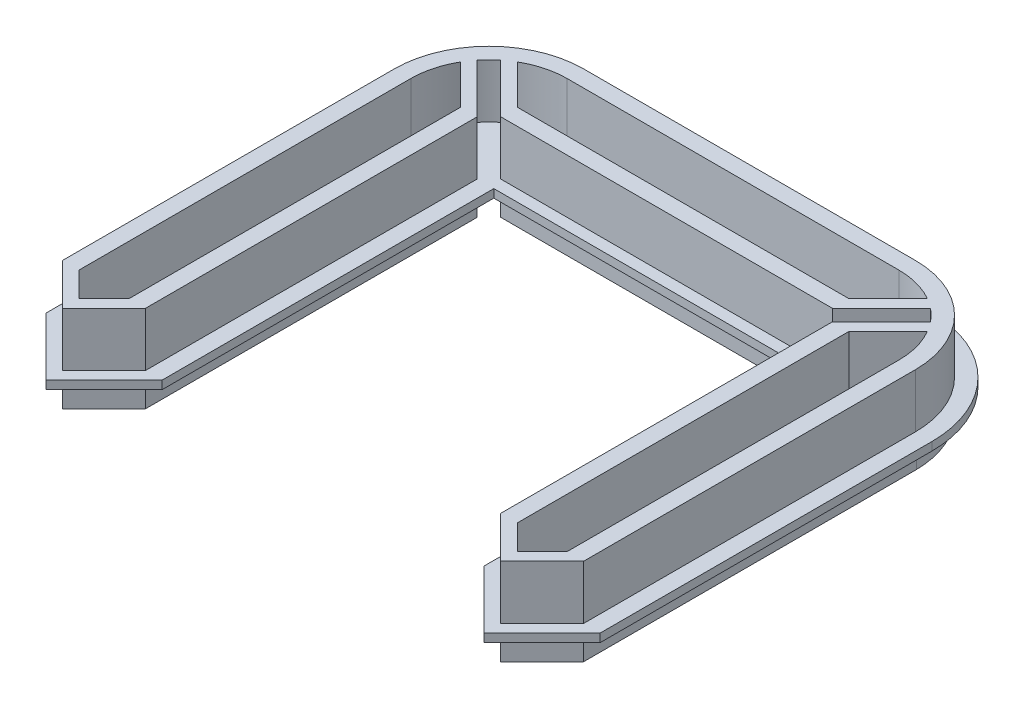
from build123d import *

# Parameters (mm, degrees)
SALIENTE_EXTRUIR3_DEPTH   = 4
SALIENTE_EXTRUIR3_2_DEPTH = 4
SALIENTE_EXTRUIR3_3_DEPTH = 4
SALIENTE_EXTRUIR4_START   = -1
SALIENTE_EXTRUIR4_DEPTH   = 1
SALIENTE_EXTRUIR5_START   = -1
SALIENTE_EXTRUIR5_DEPTH   = 1
CORTAR_EXTRUIR2_DEPTH     = 4
SALIENTE_EXTRUIR6_DEPTH   = 1
SALIENTE_EXTRUIR7_DEPTH   = 6.5


with BuildPart() as part:
    # Croquis1 → Saliente-Extruir3 (new body)
    with BuildSketch(Plane(origin=(0, 0, 0), x_dir=(1, 0, 0), z_dir=(0, 1, 0))):
        with BuildLine():
            Line((20, -5), (-20, -5))
            Line((-20, -5), (-25, 0))
            Line((-25, 0), (-27.332237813, 2.332237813))
            ThreePointArc((-27.332237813, 2.332237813), (-23.900438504, 4.312345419), (-19.998489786, 5))
            Line((-19.998489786, 5), (20, 5))
            ThreePointArc((20, 5), (23.901397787, 4.312484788), (27.332768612, 2.332768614))
            Line((27.332768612, 2.332768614), (25, 0))
            Line((25, 0), (20, -5))
        make_face()
    extrude(amount=SALIENTE_EXTRUIR3_DEPTH)



with BuildPart() as body_2:
    # Croquis1 → Saliente-Extruir3 2 (new body)
    with BuildSketch(Plane(origin=(0, 0, 0), x_dir=(1, 0, 0), z_dir=(0, 1, 0))):
        with BuildLine():
            Line((21.414213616, -6.414213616), (21.414213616, -46.414213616))
            Line((21.414213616, -46.414213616), (26.413458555, -51.413458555))
            Line((26.413458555, -51.413458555), (31.412703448, -46.414213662))
            Line((31.412703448, -46.414213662), (31.412703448, -6.414213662))
            Line((31.412703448, -6.414213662), (31.412703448, -6.300394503))
            ThreePointArc((31.412703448, -6.300394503), (30.706558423, -2.459510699), (28.746898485, 0.918471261))
            Line((28.746898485, 0.918471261), (26.413458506, -1.41496872))
            Line((26.413458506, -1.41496872), (21.414213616, -6.414213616))
        make_face()
    extrude(amount=SALIENTE_EXTRUIR3_2_DEPTH)


with BuildPart() as body_3:
    # Croquis1 → Saliente-Extruir3 3 (new body)
    with BuildSketch(Plane(origin=(0, 0, 0), x_dir=(1, 0, 0), z_dir=(0, 1, 0))):
        with BuildLine():
            Line((-26.413458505, -1.414968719), (-21.414213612, -6.414213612))
            Line((-21.414213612, -6.414213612), (-21.414213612, -46.414213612))
            Line((-21.414213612, -46.414213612), (-26.413458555, -51.413458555))
            Line((-26.413458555, -51.413458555), (-31.412703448, -46.414213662))
            Line((-31.412703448, -46.414213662), (-31.412703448, -6.414213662))
            ThreePointArc((-31.412703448, -6.414213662), (-30.725415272, -2.513272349), (-28.746318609, 0.917891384))
            Line((-28.746318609, 0.917891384), (-26.413458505, -1.414968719))
        make_face()
    extrude(amount=SALIENTE_EXTRUIR3_3_DEPTH)


with BuildPart() as part_1:
    add(part.part)

    add(body_2.part)  # Saliente-Extruir4 merges body 2

    add(body_3.part)  # Saliente-Extruir4 merges body 3
    # Croquis3 → Saliente-Extruir4 (add)
    with BuildSketch(Plane(origin=(0, 4, 0), x_dir=(1, 0, 0), z_dir=(0, 1, 0)).offset(SALIENTE_EXTRUIR4_START)):
        with BuildLine():
            Line((-21.414213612, -6.414213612), (-20, -5))
            Line((-20, -5), (-27.332237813, 2.332237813))
            ThreePointArc((-27.332237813, 2.332237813), (-28.070315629, 1.656096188), (-28.746318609, 0.917891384))
            Line((-28.746318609, 0.917891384), (-21.414213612, -6.414213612))
        make_face()
        with BuildLine():
            Line((20, -5), (27.332237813, 2.332237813))
            ThreePointArc((27.332237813, 2.332237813), (28.070315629, 1.656096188), (28.746318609, 0.917891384))
            Line((28.746318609, 0.917891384), (21.414213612, -6.414213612))
            Line((21.414213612, -6.414213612), (20, -5))
        make_face()
    extrude(amount=SALIENTE_EXTRUIR4_DEPTH)

    # Croquis4 → Saliente-Extruir5 (add)
    with BuildSketch(Plane(origin=(0, 4, 0), x_dir=(1, 0, 0), z_dir=(0, 1, 0)).offset(SALIENTE_EXTRUIR5_START)):
        with BuildLine():
            Line((-33.412703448, -6.414213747), (-33.412703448, -46.414213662))
            Line((-33.412703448, -46.414213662), (-26.413458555, -53.413458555))
            Line((-26.413458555, -53.413458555), (-19.414213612, -46.414213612))
            Line((-19.414213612, -46.414213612), (-19.414213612, -6.414213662))
            Line((-19.414213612, -6.414213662), (19.414213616, -6.413261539))
            Line((19.414213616, -6.413261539), (19.414213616, -46.414213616))
            Line((19.414213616, -46.414213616), (26.413458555, -53.413458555))
            Line((26.413458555, -53.413458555), (33.412703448, -46.414213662))
            Line((33.412703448, -46.414213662), (33.412703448, -6.412703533))
            ThreePointArc((33.412703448, -6.412703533), (29.484213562, 3.071510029), (20, 6.999999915))
            Line((20, 6.999999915), (-19.998489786, 6.999999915))
            ThreePointArc((-19.998489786, 6.999999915), (-29.483771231, 3.071067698), (-33.412703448, -6.414213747))
        make_face()
        with BuildLine():
            Line((-26.413458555, -51.413458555), (-31.412703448, -46.414213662))
            Line((-31.412703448, -46.414213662), (-31.412703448, -6.414213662))
            ThreePointArc((-31.412703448, -6.414213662), (-28.069557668, 1.65685422), (-19.998489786, 5))
            Line((-19.998489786, 5), (20, 5))
            ThreePointArc((20, 5), (23.901397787, 4.312484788), (27.332768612, 2.332768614))
            ThreePointArc((27.332768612, 2.332768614), (28.070872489, 1.656655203), (28.746898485, 0.918471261))
            ThreePointArc((28.746898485, 0.918471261), (30.706558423, -2.459510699), (31.412703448, -6.300394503))
            ThreePointArc((31.412703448, -6.300394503), (31.413122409, -6.356906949), (31.413261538, -6.413420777))
            Line((31.413261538, -6.413420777), (31.412703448, -46.414213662))
            Line((31.412703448, -46.414213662), (26.413458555, -51.413458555))
            Line((26.413458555, -51.413458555), (21.414213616, -46.414213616))
            Line((21.414213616, -46.414213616), (21.414213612, -6.414213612))
            Line((21.414213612, -6.414213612), (20, -5))
            Line((20, -5), (-20, -5))
            Line((-20, -5), (-21.414213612, -6.414213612))
            Line((-21.414213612, -6.414213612), (-21.414213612, -46.414213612))
            Line((-21.414213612, -46.414213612), (-26.413458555, -51.413458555))
        make_face(mode=Mode.SUBTRACT)
    extrude(amount=SALIENTE_EXTRUIR5_DEPTH)

    # Croquis6 → Cortar-Extruir2 (cut)
    with BuildSketch(Plane(origin=(0, 0, 0), x_dir=(-1, 0, 0), z_dir=(0, -1, 0))):
        with BuildLine():
            Line((22.414213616, -6.414213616), (28.471459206, -0.356968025))
            ThreePointArc((28.471459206, -0.356968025), (29.916638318, -3.233627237), (30.414213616, -6.414213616))
            Line((30.414213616, -6.414213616), (30.414213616, -46.414213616))
            Line((30.414213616, -46.414213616), (26.414213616, -50.414213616))
            Line((26.414213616, -50.414213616), (22.414213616, -46.414213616))
            Line((22.414213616, -46.414213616), (22.414213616, -6.414213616))
        make_face()
        with BuildLine():
            Line((-20, 4), (20, 4))
            ThreePointArc((20, 4), (23.180586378, 3.502424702), (26.057245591, 2.057245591))
            Line((26.057245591, 2.057245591), (20, -4))
            Line((20, -4), (-20, -4))
            Line((-20, -4), (-26.057245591, 2.057245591))
            ThreePointArc((-26.057245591, 2.057245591), (-23.180586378, 3.502424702), (-20, 4))
        make_face()
        with BuildLine():
            Line((-30.414213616, -6.414213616), (-30.414213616, -46.414213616))
            Line((-30.414213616, -46.414213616), (-26.414213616, -50.414213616))
            Line((-26.414213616, -50.414213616), (-22.414213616, -46.414213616))
            Line((-22.414213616, -46.414213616), (-22.414213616, -6.414213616))
            Line((-22.414213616, -6.414213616), (-28.471459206, -0.356968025))
            ThreePointArc((-28.471459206, -0.356968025), (-29.916638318, -3.233627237), (-30.414213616, -6.414213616))
        make_face()
    extrude(amount=-CORTAR_EXTRUIR2_DEPTH, mode=Mode.SUBTRACT)

    # Croquis7 → Saliente-Extruir6 (add)
    with BuildSketch(Plane.XZ):
        with BuildLine():
            Line((-22.414213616, 6.414213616), (-22.414213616, 46.414213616))
            Line((-22.414213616, 46.414213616), (-26.414213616, 50.414213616))
            Line((-26.414213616, 50.414213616), (-30.414213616, 46.414213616))
            Line((-30.414213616, 46.414213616), (-30.414213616, 6.414213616))
            ThreePointArc((-30.414213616, 6.414213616), (-29.916638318, 3.233627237), (-28.471459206, 0.356968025))
            Line((-28.471459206, 0.356968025), (-22.414213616, 6.414213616))
        make_face()
        with BuildLine():
            Line((-20, 4), (20, 4))
            Line((20, 4), (26.057245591, -2.057245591))
            ThreePointArc((26.057245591, -2.057245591), (23.180586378, -3.502424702), (20, -4))
            Line((20, -4), (-20, -4))
            ThreePointArc((-20, -4), (-23.180586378, -3.502424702), (-26.057245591, -2.057245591))
            Line((-26.057245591, -2.057245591), (-20, 4))
        make_face()
        with BuildLine():
            Line((22.414213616, 6.414213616), (22.414213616, 46.414213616))
            Line((22.414213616, 46.414213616), (26.414213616, 50.414213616))
            Line((26.414213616, 50.414213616), (30.414213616, 46.414213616))
            Line((30.414213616, 46.414213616), (30.414213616, 6.414213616))
            ThreePointArc((30.414213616, 6.414213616), (29.916638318, 3.233627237), (28.471459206, 0.356968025))
            Line((28.471459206, 0.356968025), (22.414213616, 6.414213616))
        make_face()
    extrude(amount=-SALIENTE_EXTRUIR6_DEPTH)

    # Croquis8 → Saliente-Extruir7 (add)
    with BuildSketch(Plane(origin=(0, 4, 0), x_dir=(1, 0, 0), z_dir=(0, 1, 0))):
        with BuildLine():
            Line((-21.414213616, -46.414213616), (-21.414213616, -6.414213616))
            Line((-21.414213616, -6.414213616), (-27.326299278, -0.502127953))
            ThreePointArc((-27.326299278, -0.502127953), (-26.656854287, 0.242640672), (-25.912085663, 0.912085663))
            Line((-25.912085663, 0.912085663), (-20, -5))
            Line((-20, -5), (20, -5))
            Line((20, -5), (25.912085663, 0.912085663))
            ThreePointArc((25.912085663, 0.912085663), (26.656854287, 0.242640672), (27.326299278, -0.502127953))
            Line((27.326299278, -0.502127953), (21.414213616, -6.414213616))
            Line((21.414213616, -6.414213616), (21.414213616, -46.414213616))
            Line((21.414213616, -46.414213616), (26.414213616, -51.414213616))
            Line((26.414213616, -51.414213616), (31.414213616, -46.414213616))
            Line((31.414213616, -46.414213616), (31.414213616, -6.414213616))
            ThreePointArc((31.414213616, -6.414213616), (28.07106785, 1.656854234), (20, 5))
            Line((20, 5), (-20, 5))
            ThreePointArc((-20, 5), (-28.07106785, 1.656854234), (-31.414213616, -6.414213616))
            Line((-31.414213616, -6.414213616), (-31.414213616, -46.414213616))
            Line((-31.414213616, -46.414213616), (-26.414213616, -51.414213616))
            Line((-26.414213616, -51.414213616), (-21.414213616, -46.414213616))
        make_face()
        with BuildLine():
            Line((-23.414213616, -6.414213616), (-23.414213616, -46.414213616))
            Line((-23.414213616, -46.414213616), (-26.414213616, -49.414213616))
            Line((-26.414213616, -49.414213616), (-29.414213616, -46.414213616))
            Line((-29.414213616, -46.414213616), (-29.414213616, -6.414213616))
            ThreePointArc((-29.414213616, -6.414213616), (-29.090429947, -3.966459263), (-28.141350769, -1.687076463))
            Line((-28.141350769, -1.687076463), (-23.414213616, -6.414213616))
        make_face(mode=Mode.SUBTRACT)
        with BuildLine():
            Line((20, -3), (-20, -3))
            Line((-20, -3), (-24.727137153, 1.727137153))
            ThreePointArc((-24.727137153, 1.727137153), (-22.447754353, 2.676216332), (-20, 3))
            Line((-20, 3), (20, 3))
            ThreePointArc((20, 3), (22.447754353, 2.676216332), (24.727137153, 1.727137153))
            Line((24.727137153, 1.727137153), (20, -3))
        make_face(mode=Mode.SUBTRACT)
        with BuildLine():
            Line((29.414213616, -46.414213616), (26.414213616, -49.414213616))
            Line((26.414213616, -49.414213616), (23.414213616, -46.414213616))
            Line((23.414213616, -46.414213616), (23.414213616, -6.414213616))
            Line((23.414213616, -6.414213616), (28.141350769, -1.687076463))
            ThreePointArc((28.141350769, -1.687076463), (29.090429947, -3.966459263), (29.414213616, -6.414213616))
            Line((29.414213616, -6.414213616), (29.414213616, -46.414213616))
        make_face(mode=Mode.SUBTRACT)
    extrude(amount=SALIENTE_EXTRUIR7_DEPTH)


solid = part_1.part
